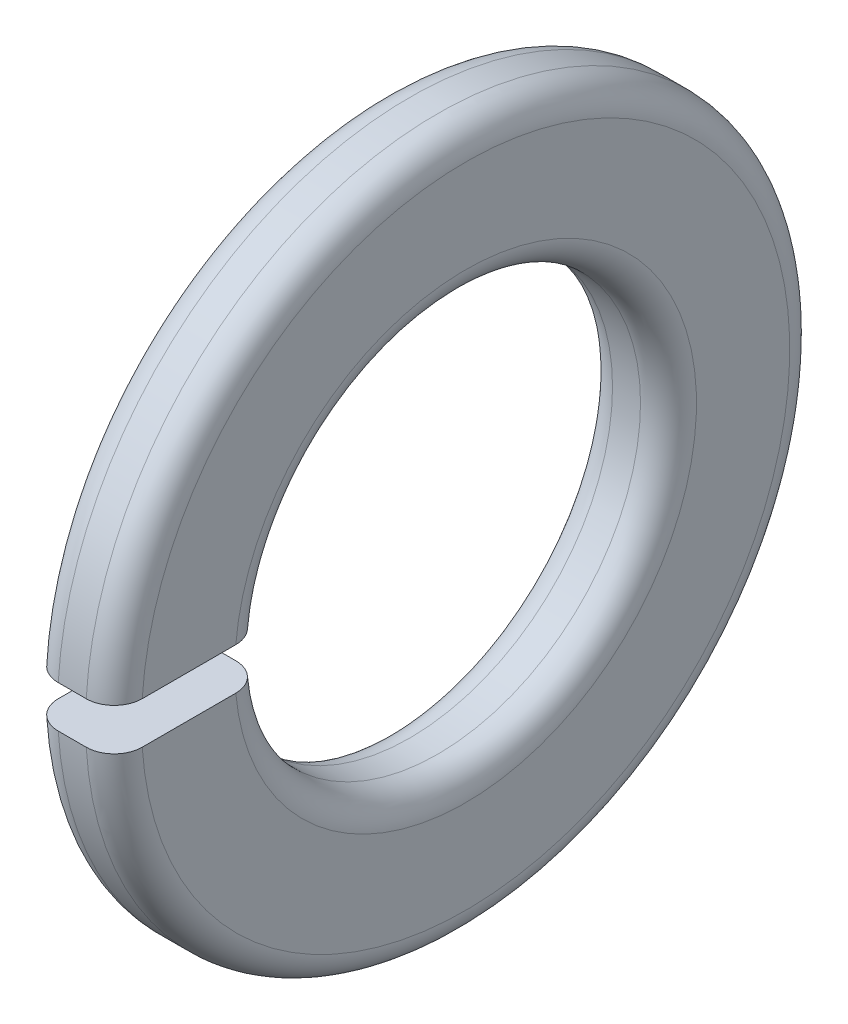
from build123d import *

# Parameters (mm, degrees)
SKETCH2_W = 0.45
SKETCH2_H = 3.8505
GAP_DEPTH = 6.413986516


with BuildPart() as part:
    # Sketch1 → Base-Revolve (revolve)
    with BuildSketch(Plane.XY, mode=Mode.PRIVATE) as base_revolve_sk:
        with BuildLine():
            Line((0, 2.475), (0, 3.475))
            ThreePointArc((0, 3.475), (-0.087867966, 3.687132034), (-0.3, 3.775))
            Line((-0.3, 3.775), (-0.6, 3.775))
            ThreePointArc((-0.6, 3.775), (-0.812132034, 3.687132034), (-0.9, 3.475))
            Line((-0.9, 3.475), (-0.9, 2.475))
            ThreePointArc((-0.9, 2.475), (-0.812132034, 2.262867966), (-0.6, 2.175))
            Line((-0.6, 2.175), (-0.3, 2.175))
            ThreePointArc((-0.3, 2.175), (-0.087867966, 2.262867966), (0, 2.475))
        make_face()
    revolve(base_revolve_sk.sketch.rotate(Axis((-34.925, 0, 0), (1, 0, 0)), 90), axis=Axis((-34.925, 0, 0), (1, 0, 0)))

    # Sketch2 → Gap (cut, through all)
    with BuildSketch(Plane(origin=(0, 0, 0), x_dir=(0, -1, 0), z_dir=(-1, 0, 0))):
        with Locations((0, 1.92525)):
            Rectangle(SKETCH2_W, SKETCH2_H)
    extrude(amount=GAP_DEPTH, mode=Mode.SUBTRACT)


solid = part.part
